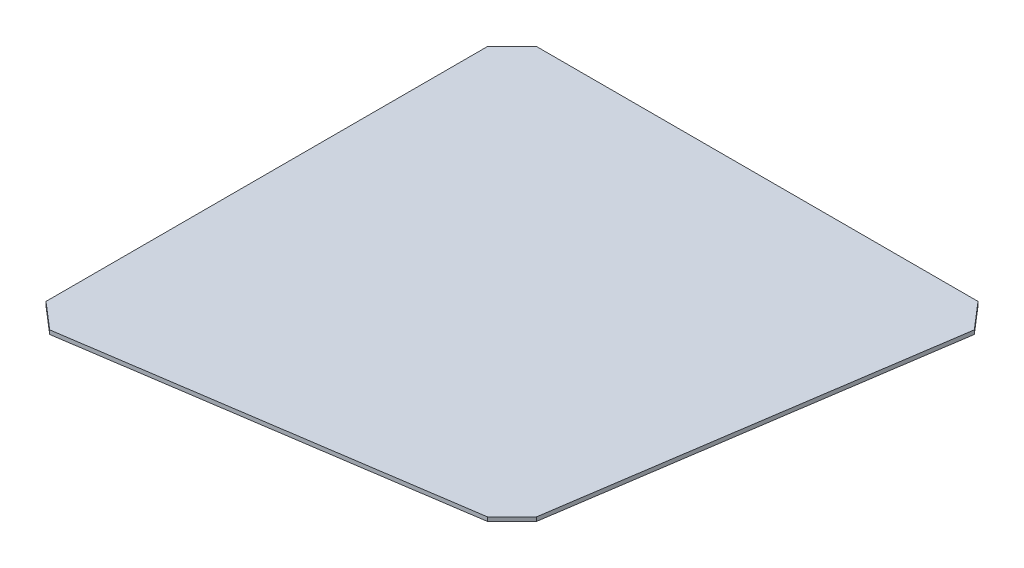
ISO-10303-21;
HEADER;
FILE_DESCRIPTION(('STEP AP214'),'2;1');
FILE_NAME('part.step','',(''),(''),'','','');
FILE_SCHEMA(('AUTOMOTIVE_DESIGN { 1 0 10303 214 1 1 1 1 }'));
ENDSEC;
DATA;
#1=APPLICATION_CONTEXT('core data for automotive mechanical design processes');
#2=APPLICATION_PROTOCOL_DEFINITION('international standard','automotive_design',2000,#1);
#3=PRODUCT_CONTEXT('',#1,'mechanical');
#4=PRODUCT('Part','Part','',(#3));
#5=PRODUCT_RELATED_PRODUCT_CATEGORY('part','',(#4));
#6=PRODUCT_DEFINITION_FORMATION('','',#4);
#7=PRODUCT_DEFINITION_CONTEXT('part definition',#1,'design');
#8=PRODUCT_DEFINITION('design','',#6,#7);
#9=PRODUCT_DEFINITION_SHAPE('','',#8);
#10=(LENGTH_UNIT() NAMED_UNIT(*) SI_UNIT(.MILLI.,.METRE.));
#11=(NAMED_UNIT(*) PLANE_ANGLE_UNIT() SI_UNIT($,.RADIAN.));
#12=(NAMED_UNIT(*) SI_UNIT($,.STERADIAN.) SOLID_ANGLE_UNIT());
#13=UNCERTAINTY_MEASURE_WITH_UNIT(LENGTH_MEASURE(1.E-05),#10,'distance_accuracy_value','');
#14=(GEOMETRIC_REPRESENTATION_CONTEXT(3) GLOBAL_UNCERTAINTY_ASSIGNED_CONTEXT((#13)) GLOBAL_UNIT_ASSIGNED_CONTEXT((#10,
#11,#12)) REPRESENTATION_CONTEXT('',''));
#15=CARTESIAN_POINT('',(0.,0.,0.));
#16=DIRECTION('',(0.,0.,1.));
#17=DIRECTION('',(1.,0.,0.));
#18=AXIS2_PLACEMENT_3D('',#15,#16,#17);
#19=CARTESIAN_POINT('',(4.36562499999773,875.79835,1217.21562500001));
#20=DIRECTION('',(-0.999999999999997,0.,0.));
#21=DIRECTION('',(0.,0.,1.00000000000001));
#22=AXIS2_PLACEMENT_3D('',#19,#20,#21);
#23=PLANE('',#22);
#24=DIRECTION('',(0.,1.,0.));
#25=VECTOR('',#24,1.);
#26=CARTESIAN_POINT('',(4.36562500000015,875.79835,58.2471617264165));
#27=LINE('',#26,#25);
#28=CARTESIAN_POINT('',(4.36562500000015,875.79835,58.2471617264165));
#29=VERTEX_POINT('',#28);
#30=CARTESIAN_POINT('',(4.36562500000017,884.5296,58.2471617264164));
#31=VERTEX_POINT('',#30);
#32=EDGE_CURVE('E51',#29,#31,#27,.T.);
#33=ORIENTED_EDGE('',*,*,#32,.F.);
#34=DIRECTION('',(0.,0.,1.00000000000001));
#35=VECTOR('',#34,1.);
#36=CARTESIAN_POINT('',(4.36562499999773,875.79835,1217.21562500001));
#37=LINE('',#36,#35);
#38=CARTESIAN_POINT('',(4.36562499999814,875.79835,1020.73576452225));
#39=VERTEX_POINT('',#38);
#40=EDGE_CURVE('E112',#29,#39,#37,.T.);
#41=ORIENTED_EDGE('',*,*,#40,.T.);
#42=DIRECTION('',(0.,1.,0.));
#43=VECTOR('',#42,1.);
#44=CARTESIAN_POINT('',(4.36562499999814,875.79835,1020.73576452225));
#45=LINE('',#44,#43);
#46=CARTESIAN_POINT('',(4.36562499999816,884.5296,1020.73576452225));
#47=VERTEX_POINT('',#46);
#48=EDGE_CURVE('E146',#39,#47,#45,.T.);
#49=ORIENTED_EDGE('',*,*,#48,.T.);
#50=DIRECTION('',(0.,0.,1.00000000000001));
#51=VECTOR('',#50,1.);
#52=CARTESIAN_POINT('',(4.36562499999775,884.5296,1217.21562500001));
#53=LINE('',#52,#51);
#54=EDGE_CURVE('E113',#31,#47,#53,.T.);
#55=ORIENTED_EDGE('',*,*,#54,.F.);
#56=EDGE_LOOP('',(#33,#41,#49,#55));
#57=FACE_BOUND('',#56,.T.);
#58=ADVANCED_FACE('F37',(#57),#23,.T.);
#59=CARTESIAN_POINT('',(4.36562500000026,875.79835,4.3656250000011));
#60=DIRECTION('',(0.,0.,-1.00000000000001));
#61=DIRECTION('',(-0.999999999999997,0.,0.));
#62=AXIS2_PLACEMENT_3D('',#59,#60,#61);
#63=PLANE('',#62);
#64=DIRECTION('',(0.,1.,0.));
#65=VECTOR('',#64,1.);
#66=CARTESIAN_POINT('',(58.247161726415,875.79835,4.36562500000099));
#67=LINE('',#66,#65);
#68=CARTESIAN_POINT('',(58.247161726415,875.79835,4.36562500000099));
#69=VERTEX_POINT('',#68);
#70=CARTESIAN_POINT('',(58.247161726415,884.5296,4.36562500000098));
#71=VERTEX_POINT('',#70);
#72=EDGE_CURVE('E102',#69,#71,#67,.T.);
#73=ORIENTED_EDGE('',*,*,#72,.T.);
#74=DIRECTION('',(-0.999999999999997,0.,0.));
#75=VECTOR('',#74,1.);
#76=CARTESIAN_POINT('',(4.36562500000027,884.5296,4.3656250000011));
#77=LINE('',#76,#75);
#78=CARTESIAN_POINT('',(1020.73576452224,884.5296,4.36562499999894));
#79=VERTEX_POINT('',#78);
#80=EDGE_CURVE('E118',#79,#71,#77,.T.);
#81=ORIENTED_EDGE('',*,*,#80,.F.);
#82=DIRECTION('',(0.,1.,0.));
#83=VECTOR('',#82,1.);
#84=CARTESIAN_POINT('',(1020.73576452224,875.79835,4.36562499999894));
#85=LINE('',#84,#83);
#86=CARTESIAN_POINT('',(1020.73576452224,875.79835,4.36562499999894));
#87=VERTEX_POINT('',#86);
#88=EDGE_CURVE('E159',#87,#79,#85,.T.);
#89=ORIENTED_EDGE('',*,*,#88,.F.);
#90=DIRECTION('',(-0.999999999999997,0.,0.));
#91=VECTOR('',#90,1.);
#92=CARTESIAN_POINT('',(4.36562500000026,875.79835,4.3656250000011));
#93=LINE('',#92,#91);
#94=EDGE_CURVE('E117',#87,#69,#93,.T.);
#95=ORIENTED_EDGE('',*,*,#94,.T.);
#96=EDGE_LOOP('',(#73,#81,#89,#95));
#97=FACE_BOUND('',#96,.T.);
#98=ADVANCED_FACE('F177',(#97),#63,.T.);
#99=CARTESIAN_POINT('',(3.28503751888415E-13,875.79835,1.0923058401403E-12));
#100=DIRECTION('',(0.,-1.,0.));
#101=DIRECTION('',(0.,0.,-1.00000000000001));
#102=AXIS2_PLACEMENT_3D('',#99,#100,#101);
#103=PLANE('',#102);
#104=DIRECTION('',(0.707106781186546,0.,-0.707106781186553));
#105=VECTOR('',#104,1.);
#106=CARTESIAN_POINT('',(4.36562500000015,875.79835,58.2471617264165));
#107=LINE('',#106,#105);
#108=EDGE_CURVE('E99',#29,#69,#107,.T.);
#109=ORIENTED_EDGE('',*,*,#108,.T.);
#110=ORIENTED_EDGE('',*,*,#94,.F.);
#111=DIRECTION('',(0.652723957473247,0.,0.75759582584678));
#112=VECTOR('',#111,1.);
#113=CARTESIAN_POINT('',(1020.73576452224,875.79835,4.36562499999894));
#114=LINE('',#113,#112);
#115=CARTESIAN_POINT('',(1070.4733300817,875.79835,62.0944269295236));
#116=VERTEX_POINT('',#115);
#117=EDGE_CURVE('E153',#87,#116,#114,.T.);
#118=ORIENTED_EDGE('',*,*,#117,.T.);
#119=DIRECTION('',(0.147902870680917,0.,-0.989001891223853));
#120=VECTOR('',#119,1.);
#121=CARTESIAN_POINT('',(898.358698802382,875.79835,1212.99633342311));
#122=LINE('',#121,#120);
#123=CARTESIAN_POINT('',(946.300307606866,875.79835,892.418770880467));
#124=VERTEX_POINT('',#123);
#125=EDGE_CURVE('E164',#124,#116,#122,.T.);
#126=ORIENTED_EDGE('',*,*,#125,.F.);
#127=DIRECTION('',(-0.707106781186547,0.,0.707106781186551));
#128=VECTOR('',#127,1.);
#129=CARTESIAN_POINT('',(892.418770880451,875.79835,946.300307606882));
#130=LINE('',#129,#128);
#131=CARTESIAN_POINT('',(892.418770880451,875.79835,946.300307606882));
#132=VERTEX_POINT('',#131);
#133=EDGE_CURVE('E145',#124,#132,#130,.T.);
#134=ORIENTED_EDGE('',*,*,#133,.T.);
#135=DIRECTION('',(-0.989001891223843,0.,0.147902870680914));
#136=VECTOR('',#135,1.);
#137=CARTESIAN_POINT('',(1214.27350765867,875.79835,898.167700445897));
#138=LINE('',#137,#136);
#139=CARTESIAN_POINT('',(62.0944269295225,875.79835,1070.47333008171));
#140=VERTEX_POINT('',#139);
#141=EDGE_CURVE('E124',#132,#140,#138,.T.);
#142=ORIENTED_EDGE('',*,*,#141,.T.);
#143=DIRECTION('',(-0.757595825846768,0.,-0.652723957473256));
#144=VECTOR('',#143,1.);
#145=CARTESIAN_POINT('',(4.36562499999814,875.79835,1020.73576452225));
#146=LINE('',#145,#144);
#147=EDGE_CURVE('E59',#140,#39,#146,.T.);
#148=ORIENTED_EDGE('',*,*,#147,.T.);
#149=ORIENTED_EDGE('',*,*,#40,.F.);
#150=EDGE_LOOP('',(#109,#110,#118,#126,#134,#142,#148,#149));
#151=FACE_BOUND('',#150,.T.);
#152=ADVANCED_FACE('F115',(#151),#103,.T.);
#153=CARTESIAN_POINT('',(3.31778761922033E-13,884.5296,1.10319555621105E-12));
#154=DIRECTION('',(0.,-1.,0.));
#155=DIRECTION('',(0.,0.,-1.00000000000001));
#156=AXIS2_PLACEMENT_3D('',#153,#154,#155);
#157=PLANE('',#156);
#158=ORIENTED_EDGE('',*,*,#80,.T.);
#159=DIRECTION('',(0.707106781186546,0.,-0.707106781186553));
#160=VECTOR('',#159,1.);
#161=CARTESIAN_POINT('',(4.36562500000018,884.5296,58.2471617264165));
#162=LINE('',#161,#160);
#163=EDGE_CURVE('E107',#31,#71,#162,.T.);
#164=ORIENTED_EDGE('',*,*,#163,.F.);
#165=ORIENTED_EDGE('',*,*,#54,.T.);
#166=DIRECTION('',(-0.757595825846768,0.,-0.652723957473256));
#167=VECTOR('',#166,1.);
#168=CARTESIAN_POINT('',(4.36562499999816,884.5296,1020.73576452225));
#169=LINE('',#168,#167);
#170=CARTESIAN_POINT('',(62.0944269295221,884.5296,1070.47333008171));
#171=VERTEX_POINT('',#170);
#172=EDGE_CURVE('E136',#171,#47,#169,.T.);
#173=ORIENTED_EDGE('',*,*,#172,.F.);
#174=DIRECTION('',(0.989001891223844,0.,-0.147902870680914));
#175=VECTOR('',#174,1.);
#176=CARTESIAN_POINT('',(157.943122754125,884.5296,1056.13938654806));
#177=LINE('',#176,#175);
#178=CARTESIAN_POINT('',(892.418770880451,884.5296,946.300307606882));
#179=VERTEX_POINT('',#178);
#180=EDGE_CURVE('E44',#171,#179,#177,.T.);
#181=ORIENTED_EDGE('',*,*,#180,.T.);
#182=DIRECTION('',(-0.707106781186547,0.,0.707106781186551));
#183=VECTOR('',#182,1.);
#184=CARTESIAN_POINT('',(892.418770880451,884.5296,946.300307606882));
#185=LINE('',#184,#183);
#186=CARTESIAN_POINT('',(946.300307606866,884.5296,892.418770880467));
#187=VERTEX_POINT('',#186);
#188=EDGE_CURVE('E133',#187,#179,#185,.T.);
#189=ORIENTED_EDGE('',*,*,#188,.F.);
#190=DIRECTION('',(0.147902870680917,0.,-0.989001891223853));
#191=VECTOR('',#190,1.);
#192=CARTESIAN_POINT('',(1056.13938654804,884.5296,157.943122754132));
#193=LINE('',#192,#191);
#194=CARTESIAN_POINT('',(1070.4733300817,884.5296,62.0944269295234));
#195=VERTEX_POINT('',#194);
#196=EDGE_CURVE('E12',#187,#195,#193,.T.);
#197=ORIENTED_EDGE('',*,*,#196,.T.);
#198=DIRECTION('',(0.652723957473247,0.,0.75759582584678));
#199=VECTOR('',#198,1.);
#200=CARTESIAN_POINT('',(1020.73576452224,884.5296,4.36562499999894));
#201=LINE('',#200,#199);
#202=EDGE_CURVE('E150',#79,#195,#201,.T.);
#203=ORIENTED_EDGE('',*,*,#202,.F.);
#204=EDGE_LOOP('',(#158,#164,#165,#173,#181,#189,#197,#203));
#205=FACE_BOUND('',#204,.T.);
#206=ADVANCED_FACE('F132',(#205),#157,.F.);
#207=CARTESIAN_POINT('',(1214.27350765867,884.5296,898.167700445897));
#208=DIRECTION('',(-0.147902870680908,0.,-0.989001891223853));
#209=DIRECTION('',(-0.989001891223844,0.,0.147902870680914));
#210=AXIS2_PLACEMENT_3D('',#207,#208,#209);
#211=PLANE('',#210);
#212=ORIENTED_EDGE('',*,*,#180,.F.);
#213=DIRECTION('',(0.,1.,0.));
#214=VECTOR('',#213,1.);
#215=CARTESIAN_POINT('',(62.0944269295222,875.79835,1070.47333008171));
#216=LINE('',#215,#214);
#217=EDGE_CURVE('E169',#140,#171,#216,.T.);
#218=ORIENTED_EDGE('',*,*,#217,.F.);
#219=ORIENTED_EDGE('',*,*,#141,.F.);
#220=DIRECTION('',(0.,1.,0.));
#221=VECTOR('',#220,1.);
#222=CARTESIAN_POINT('',(892.418770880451,875.79835,946.300307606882));
#223=LINE('',#222,#221);
#224=EDGE_CURVE('E141',#132,#179,#223,.T.);
#225=ORIENTED_EDGE('',*,*,#224,.T.);
#226=EDGE_LOOP('',(#212,#218,#219,#225));
#227=FACE_BOUND('',#226,.T.);
#228=ADVANCED_FACE('F149',(#227),#211,.F.);
#229=CARTESIAN_POINT('',(898.358698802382,875.79835,1212.99633342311));
#230=DIRECTION('',(-0.989001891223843,0.,-0.147902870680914));
#231=DIRECTION('',(-0.147902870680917,0.,0.989001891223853));
#232=AXIS2_PLACEMENT_3D('',#229,#230,#231);
#233=PLANE('',#232);
#234=ORIENTED_EDGE('',*,*,#196,.F.);
#235=DIRECTION('',(0.,1.,0.));
#236=VECTOR('',#235,1.);
#237=CARTESIAN_POINT('',(946.300307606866,875.79835,892.418770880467));
#238=LINE('',#237,#236);
#239=EDGE_CURVE('E144',#124,#187,#238,.T.);
#240=ORIENTED_EDGE('',*,*,#239,.F.);
#241=ORIENTED_EDGE('',*,*,#125,.T.);
#242=DIRECTION('',(0.,1.,0.));
#243=VECTOR('',#242,1.);
#244=CARTESIAN_POINT('',(1070.4733300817,875.79835,62.0944269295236));
#245=LINE('',#244,#243);
#246=EDGE_CURVE('E161',#116,#195,#245,.T.);
#247=ORIENTED_EDGE('',*,*,#246,.T.);
#248=EDGE_LOOP('',(#234,#240,#241,#247));
#249=FACE_BOUND('',#248,.T.);
#250=ADVANCED_FACE('F182',(#249),#233,.F.);
#251=CARTESIAN_POINT('',(1020.73576452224,875.79835,4.36562499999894));
#252=DIRECTION('',(-0.757595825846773,0.,0.652723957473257));
#253=DIRECTION('',(0.652723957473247,0.,0.75759582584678));
#254=AXIS2_PLACEMENT_3D('',#251,#252,#253);
#255=PLANE('',#254);
#256=ORIENTED_EDGE('',*,*,#202,.T.);
#257=ORIENTED_EDGE('',*,*,#246,.F.);
#258=ORIENTED_EDGE('',*,*,#117,.F.);
#259=ORIENTED_EDGE('',*,*,#88,.T.);
#260=EDGE_LOOP('',(#256,#257,#258,#259));
#261=FACE_BOUND('',#260,.T.);
#262=ADVANCED_FACE('F181',(#261),#255,.F.);
#263=CARTESIAN_POINT('',(892.418770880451,875.79835,946.300307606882));
#264=DIRECTION('',(-0.707106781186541,0.,-0.707106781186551));
#265=DIRECTION('',(-0.707106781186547,0.,0.707106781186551));
#266=AXIS2_PLACEMENT_3D('',#263,#264,#265);
#267=PLANE('',#266);
#268=ORIENTED_EDGE('',*,*,#188,.T.);
#269=ORIENTED_EDGE('',*,*,#224,.F.);
#270=ORIENTED_EDGE('',*,*,#133,.F.);
#271=ORIENTED_EDGE('',*,*,#239,.T.);
#272=EDGE_LOOP('',(#268,#269,#270,#271));
#273=FACE_BOUND('',#272,.T.);
#274=ADVANCED_FACE('F140',(#273),#267,.F.);
#275=CARTESIAN_POINT('',(4.36562499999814,875.79835,1020.73576452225));
#276=DIRECTION('',(0.652723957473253,0.,-0.757595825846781));
#277=DIRECTION('',(-0.757595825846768,0.,-0.652723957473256));
#278=AXIS2_PLACEMENT_3D('',#275,#276,#277);
#279=PLANE('',#278);
#280=ORIENTED_EDGE('',*,*,#172,.T.);
#281=ORIENTED_EDGE('',*,*,#48,.F.);
#282=ORIENTED_EDGE('',*,*,#147,.F.);
#283=ORIENTED_EDGE('',*,*,#217,.T.);
#284=EDGE_LOOP('',(#280,#281,#282,#283));
#285=FACE_BOUND('',#284,.T.);
#286=ADVANCED_FACE('F222',(#285),#279,.F.);
#287=CARTESIAN_POINT('',(4.36562500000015,875.79835,58.2471617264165));
#288=DIRECTION('',(0.707106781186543,0.,0.707106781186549));
#289=DIRECTION('',(0.707106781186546,0.,-0.707106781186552));
#290=AXIS2_PLACEMENT_3D('',#287,#288,#289);
#291=PLANE('',#290);
#292=ORIENTED_EDGE('',*,*,#163,.T.);
#293=ORIENTED_EDGE('',*,*,#72,.F.);
#294=ORIENTED_EDGE('',*,*,#108,.F.);
#295=ORIENTED_EDGE('',*,*,#32,.T.);
#296=EDGE_LOOP('',(#292,#293,#294,#295));
#297=FACE_BOUND('',#296,.T.);
#298=ADVANCED_FACE('F100',(#297),#291,.F.);
#299=CLOSED_SHELL('',(#58,#98,#152,#206,#228,#250,#262,#274,#286,#298));
#300=MANIFOLD_SOLID_BREP('B2',#299);
#301=ADVANCED_BREP_SHAPE_REPRESENTATION('',(#18,#300),#14);
#302=SHAPE_DEFINITION_REPRESENTATION(#9,#301);
ENDSEC;
END-ISO-10303-21;
